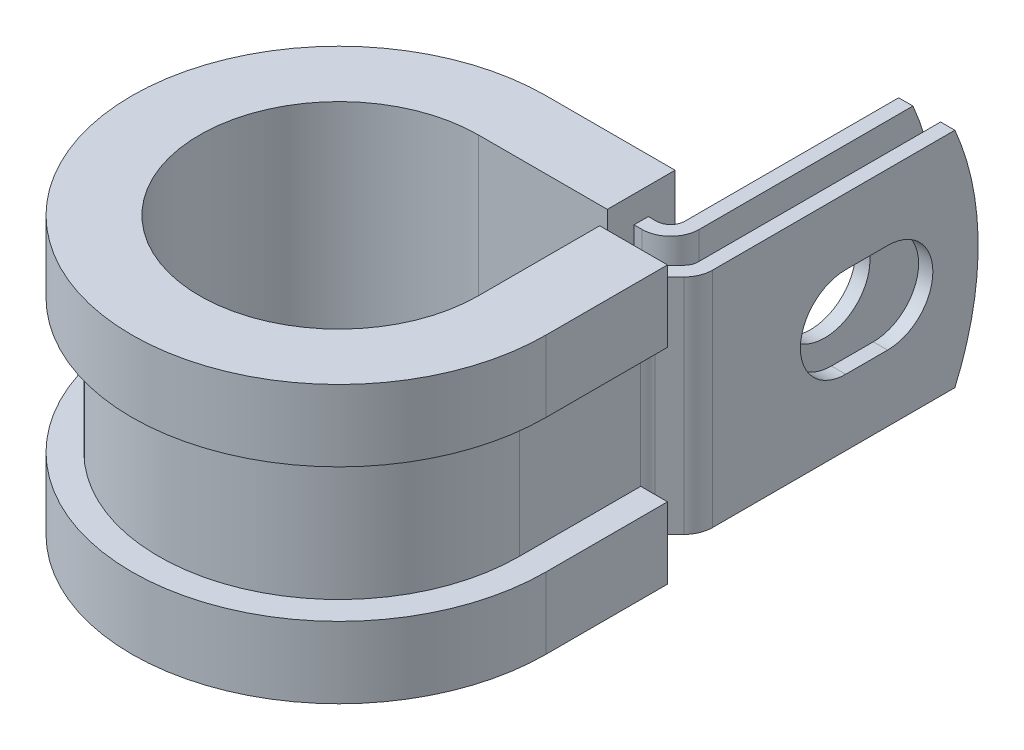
from build123d import *

# Parameters (mm, degrees)
EXTRUDE_THIN1_DEPTH = 6.35
SKETCH2_R           = 2.5781
CUT_EXTRUDE1_DEPTH  = 0.8128
CUT_EXTRUDE2_DEPTH  = 0.8128
CUT_EXTRUDE3_DEPTH  = 32.64855678


with BuildPart() as part:
    # Sketch1 → Extrude-Thin1 (new, symmetric)
    with BuildSketch(Plane(origin=(0, 0, 0), x_dir=(1, 0, 0), z_dir=(0, 1, 0))):
        with BuildLine():
            Line((11.001874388, 24.5872), (11.001874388, 9.4615))
            ThreePointArc((11.001874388, 9.4615), (10.940003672, 9.150454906), (10.76381078, 8.886763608))
            Line((10.76381078, 8.886763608), (9.937627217, 8.060580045))
            ThreePointArc((9.937627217, 8.060580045), (9.585241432, 7.533197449), (9.4615, 6.911107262))
            Line((9.4615, 6.911107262), (9.4615, 0))
            ThreePointArc((9.4615, 0), (-6.69029081, -6.69029081), (0, 9.4615))
            Line((0, 9.4615), (7.801474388, 9.4615))
            ThreePointArc((7.801474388, 9.4615), (8.950947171, 9.937627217), (9.427074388, 11.0871))
            Line((9.427074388, 11.0871), (9.427074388, 24.5872))
            Line((9.427074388, 24.5872), (8.614274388, 24.5872))
            Line((8.614274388, 24.5872), (8.614274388, 11.0871))
            ThreePointArc((8.614274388, 11.0871), (8.37621078, 10.512363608), (7.801474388, 10.2743))
            Line((7.801474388, 10.2743), (0, 10.2743))
            ThreePointArc((0, 10.2743), (-7.265027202, -7.265027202), (10.2743, 0))
            Line((10.2743, 0), (10.2743, 6.911107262))
            ThreePointArc((10.2743, 6.911107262), (10.336170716, 7.222152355), (10.512363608, 7.485843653))
            Line((10.512363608, 7.485843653), (11.338547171, 8.312027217))
            ThreePointArc((11.338547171, 8.312027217), (11.690932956, 8.839409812), (11.814674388, 9.4615))
            Line((11.814674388, 9.4615), (11.814674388, 24.5872))
            Line((11.814674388, 24.5872), (11.001874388, 24.5872))
        make_face()
    extrude(amount=EXTRUDE_THIN1_DEPTH, both=True)

    # Sketch2 → Cut-Extrude1 (cut)
    with BuildSketch(Plane.ZY.offset(-8.614274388)):
        with Locations((-18.2372, 0)):
            Circle(SKETCH2_R)
    extrude(amount=-CUT_EXTRUDE1_DEPTH, mode=Mode.SUBTRACT)

    # Sketch3 → Cut-Extrude2 (cut)
    with BuildSketch(Plane(origin=(11.814674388, 0, 0), x_dir=(0, 0, -1), z_dir=(1, 0, 0))):
        with BuildLine():
            Line((17.0434, 2.5781), (19.431, 2.5781))
            ThreePointArc((19.431, 2.5781), (22.0091, 0), (19.431, -2.5781))
            Line((19.431, -2.5781), (17.0434, -2.5781))
            ThreePointArc((17.0434, -2.5781), (14.4653, 0), (17.0434, 2.5781))
        make_face()
    extrude(amount=-CUT_EXTRUDE2_DEPTH, mode=Mode.SUBTRACT)

    # Sketch4 → Cut-Extrude3 (cut, through all)
    with BuildSketch(Plane.ZY.offset(-8.614274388)):
        with BuildLine():
            Line((-23.261877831, 6.35), (-24.5872, 6.35))
            Line((-24.5872, 6.35), (-24.5872, 0))
            ThreePointArc((-24.5872, 0), (-24.252337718, 3.243415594), (-23.261877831, 6.35))
        make_face()
        with BuildLine():
            ThreePointArc((-23.261877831, -6.35), (-24.252337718, -3.243415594), (-24.5872, 0))
            Line((-24.5872, 0), (-24.5872, -6.35))
            Line((-24.5872, -6.35), (-23.261877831, -6.35))
        make_face()
    extrude(amount=-CUT_EXTRUDE3_DEPTH, mode=Mode.SUBTRACT)

    # Sweep1: sweep along a path in Sketch6
    with BuildLine(Plane(origin=(0, 6.35, 0), x_dir=(1, 0, 0), z_dir=(0, 1, 0))) as sweep1_path:
        Line((7.9375, 6.911107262), (7.9375, 0))
        ThreePointArc((7.9375, 0), (-5.612660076, -5.612660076), (0, 7.9375))
        Line((0, 7.9375), (7.344274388, 7.9375))
    # Sketch5 → Sweep1 (sweep)
    with BuildSketch(Plane(origin=(0, 0, -6.911107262), x_dir=(-1, 0, 0), z_dir=(0, 0, -1))):
        Polygon((-10.2743, 6.35), (-9.4615, 6.35), (-9.4615, -6.35), (-10.2743, -6.35), (-10.2743, -3.81), (-11.7983, -3.81), (-11.7983, -7.874), (-7.9375, -7.874), (-7.9375, 7.874), (-11.7983, 7.874), (-11.7983, 3.81), (-10.2743, 3.81), align=None)
    sweep(path=sweep1_path.line)


solid = part.part
